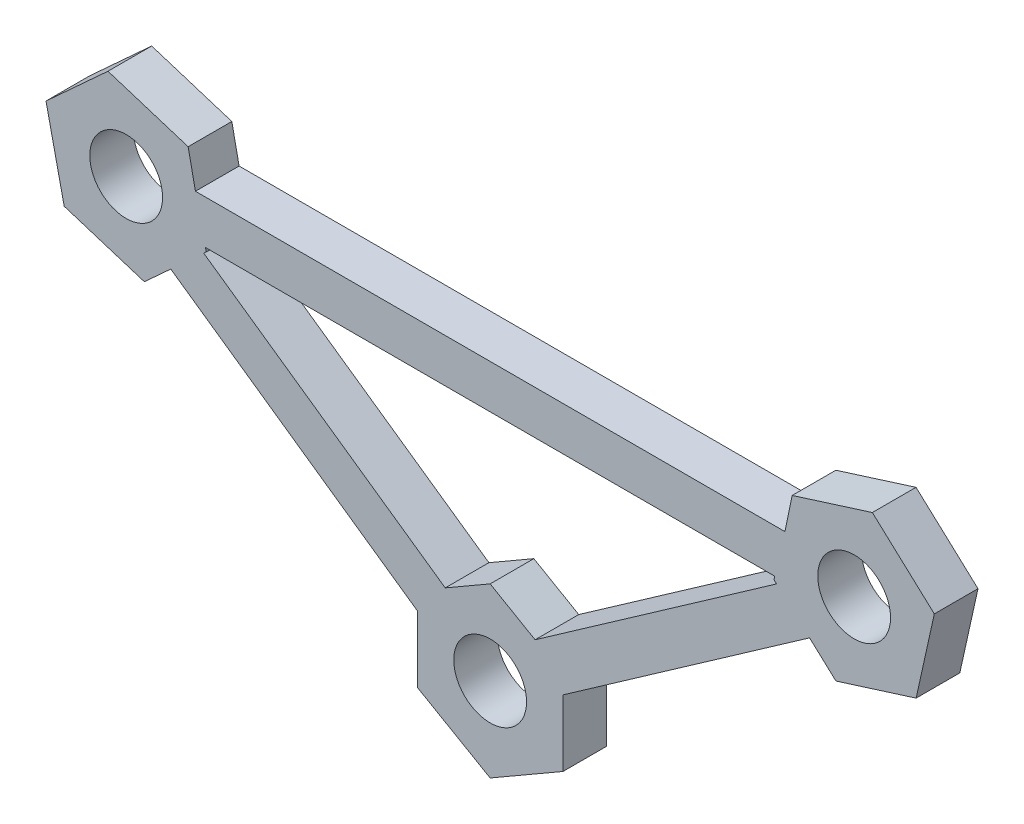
from build123d import *

# Parameters (mm, degrees)
CROQUIS1_R              = 2.5
SALIENTE_EXTRUIR1_DEPTH = 1.5


with BuildPart() as part:
    # Croquis1 → Saliente-Extruir1 (new, symmetric)
    with BuildSketch(Plane.XY):
        Polygon((-5, -11.639345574), (-5, -7.08271842), (-21.937563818, 4.777091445), (-23.750385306, 3.115946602), (-29.256672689, 4.852072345), (-30.506287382, 10.488719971), (-26.249614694, 14.389241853), (-20.743327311, 12.65311611), (-20.242607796, 10.252594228), (20.242607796, 10.252594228), (20.743327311, 12.65311611), (26.249614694, 14.389241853), (30.506287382, 10.488719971), (29.256672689, 4.852072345), (23.750385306, 3.115946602), (21.937563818, 4.777091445), (5, -7.08271842), (5, -11.639345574), (0, -14.52609692), align=None)
        with Locations((-25, 8.752594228)):
            Circle(CROQUIS1_R, mode=Mode.SUBTRACT)
        with Locations((25, 8.752594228)):
            Circle(CROQUIS1_R, mode=Mode.SUBTRACT)
        with Locations((0, -8.752594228)):
            Circle(CROQUIS1_R, mode=Mode.SUBTRACT)
        Polygon((0, -2.979091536), (-3.085841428, -4.760702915), (-19.672029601, 6.853071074), (-19.493712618, 7.016468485), (-19.549715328, 7.252594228), (19.546060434, 7.252594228), (19.493712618, 7.016468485), (19.672029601, 6.853071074), (3.085841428, -4.760702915), align=None, mode=Mode.SUBTRACT)
    extrude(amount=SALIENTE_EXTRUIR1_DEPTH, both=True)


solid = part.part
